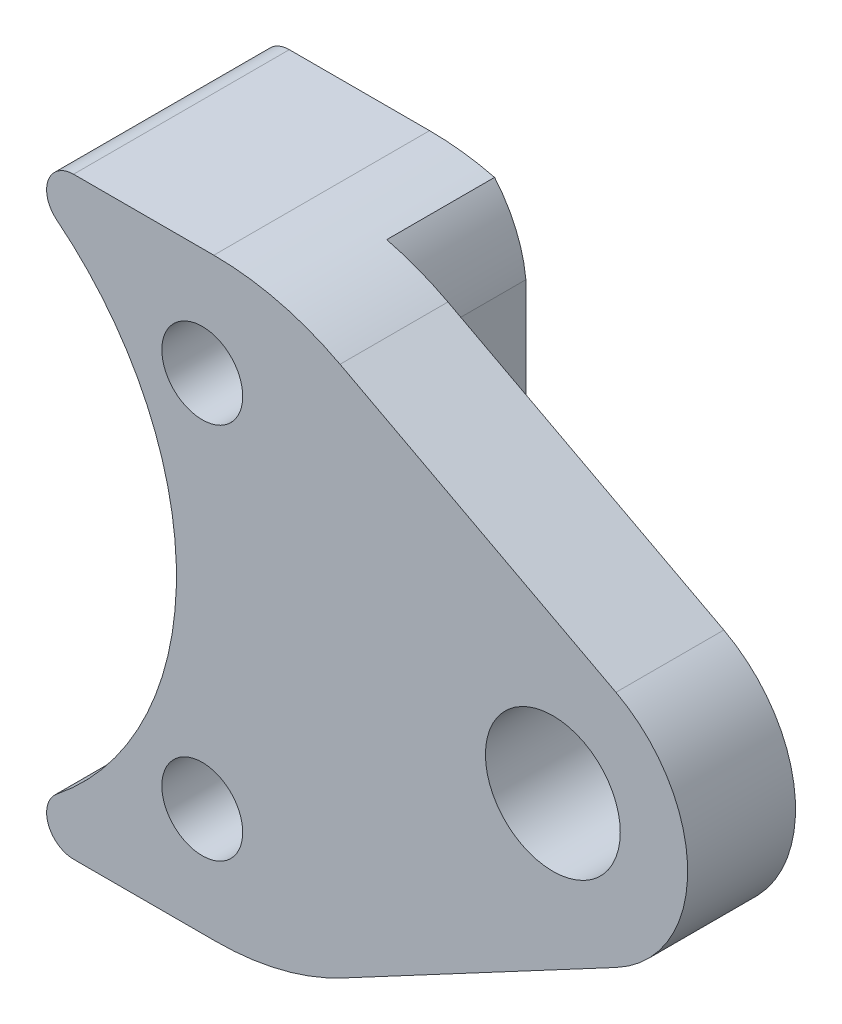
ISO-10303-21;
HEADER;
FILE_DESCRIPTION(('STEP AP214'),'2;1');
FILE_NAME('part.step','',(''),(''),'','','');
FILE_SCHEMA(('AUTOMOTIVE_DESIGN { 1 0 10303 214 1 1 1 1 }'));
ENDSEC;
DATA;
#1=APPLICATION_CONTEXT('core data for automotive mechanical design processes');
#2=APPLICATION_PROTOCOL_DEFINITION('international standard','automotive_design',2000,#1);
#3=PRODUCT_CONTEXT('',#1,'mechanical');
#4=PRODUCT('Part','Part','',(#3));
#5=PRODUCT_RELATED_PRODUCT_CATEGORY('part','',(#4));
#6=PRODUCT_DEFINITION_FORMATION('','',#4);
#7=PRODUCT_DEFINITION_CONTEXT('part definition',#1,'design');
#8=PRODUCT_DEFINITION('design','',#6,#7);
#9=PRODUCT_DEFINITION_SHAPE('','',#8);
#10=(LENGTH_UNIT() NAMED_UNIT(*) SI_UNIT(.MILLI.,.METRE.));
#11=(NAMED_UNIT(*) PLANE_ANGLE_UNIT() SI_UNIT($,.RADIAN.));
#12=(NAMED_UNIT(*) SI_UNIT($,.STERADIAN.) SOLID_ANGLE_UNIT());
#13=UNCERTAINTY_MEASURE_WITH_UNIT(LENGTH_MEASURE(1.E-05),#10,'distance_accuracy_value','');
#14=(GEOMETRIC_REPRESENTATION_CONTEXT(3) GLOBAL_UNCERTAINTY_ASSIGNED_CONTEXT((#13)) GLOBAL_UNIT_ASSIGNED_CONTEXT((#10,
#11,#12)) REPRESENTATION_CONTEXT('',''));
#15=CARTESIAN_POINT('',(0.,0.,0.));
#16=DIRECTION('',(0.,0.,1.));
#17=DIRECTION('',(1.,0.,0.));
#18=AXIS2_PLACEMENT_3D('',#15,#16,#17);
#19=CARTESIAN_POINT('',(20.,-11.,8.));
#20=DIRECTION('',(-0.470588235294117,0.882352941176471,0.));
#21=DIRECTION('',(-0.882352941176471,-0.470588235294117,0.));
#22=AXIS2_PLACEMENT_3D('',#19,#20,#21);
#23=PLANE('',#22);
#24=DIRECTION('',(-0.88235294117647,-0.470588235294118,0.));
#25=VECTOR('',#24,1.);
#26=CARTESIAN_POINT('',(22.2058823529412,-9.82352941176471,4.));
#27=LINE('',#26,#25);
#28=CARTESIAN_POINT('',(32.3529411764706,-4.41176470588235,4.));
#29=VERTEX_POINT('',#28);
#30=CARTESIAN_POINT('',(22.2058823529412,-9.82352941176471,4.));
#31=VERTEX_POINT('',#30);
#32=EDGE_CURVE('E225',#29,#31,#27,.T.);
#33=ORIENTED_EDGE('',*,*,#32,.F.);
#34=DIRECTION('',(0.,0.,-1.));
#35=VECTOR('',#34,1.);
#36=CARTESIAN_POINT('',(32.3529411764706,-4.41176470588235,8.));
#37=LINE('',#36,#35);
#38=CARTESIAN_POINT('',(32.3529411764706,-4.41176470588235,8.));
#39=VERTEX_POINT('',#38);
#40=EDGE_CURVE('E208',#39,#29,#37,.T.);
#41=ORIENTED_EDGE('',*,*,#40,.F.);
#42=DIRECTION('',(0.882352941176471,0.470588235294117,0.));
#43=VECTOR('',#42,1.);
#44=CARTESIAN_POINT('',(20.,-11.,8.));
#45=LINE('',#44,#43);
#46=CARTESIAN_POINT('',(22.2058823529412,-9.82352941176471,8.));
#47=VERTEX_POINT('',#46);
#48=EDGE_CURVE('E196',#47,#39,#45,.T.);
#49=ORIENTED_EDGE('',*,*,#48,.F.);
#50=DIRECTION('',(0.,0.,-1.));
#51=VECTOR('',#50,1.);
#52=CARTESIAN_POINT('',(22.2058823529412,-9.82352941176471,8.));
#53=LINE('',#52,#51);
#54=EDGE_CURVE('E161',#47,#31,#53,.T.);
#55=ORIENTED_EDGE('',*,*,#54,.T.);
#56=EDGE_LOOP('',(#33,#41,#49,#55));
#57=FACE_BOUND('',#56,.T.);
#58=ADVANCED_FACE('F27',(#57),#23,.F.);
#59=CARTESIAN_POINT('',(30.,0.,8.));
#60=DIRECTION('',(0.,0.,-1.));
#61=DIRECTION('',(-1.,0.,0.));
#62=AXIS2_PLACEMENT_3D('',#59,#60,#61);
#63=CYLINDRICAL_SURFACE('',#62,5.);
#64=CARTESIAN_POINT('',(30.,0.,4.));
#65=DIRECTION('',(0.,0.,-1.));
#66=DIRECTION('',(-1.,0.,0.));
#67=AXIS2_PLACEMENT_3D('',#64,#65,#66);
#68=CIRCLE('',#67,5.);
#69=CARTESIAN_POINT('',(32.3401340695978,4.41857132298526,4.));
#70=VERTEX_POINT('',#69);
#71=EDGE_CURVE('E230',#70,#29,#68,.T.);
#72=ORIENTED_EDGE('',*,*,#71,.F.);
#73=DIRECTION('',(0.,0.,-1.));
#74=VECTOR('',#73,1.);
#75=CARTESIAN_POINT('',(32.3401340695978,4.41857132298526,8.));
#76=LINE('',#75,#74);
#77=CARTESIAN_POINT('',(32.3401340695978,4.41857132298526,8.));
#78=VERTEX_POINT('',#77);
#79=EDGE_CURVE('E205',#78,#70,#76,.T.);
#80=ORIENTED_EDGE('',*,*,#79,.F.);
#81=CARTESIAN_POINT('',(30.,0.,8.));
#82=DIRECTION('',(0.,0.,1.));
#83=DIRECTION('',(-1.,0.,0.));
#84=AXIS2_PLACEMENT_3D('',#81,#82,#83);
#85=CIRCLE('',#84,5.);
#86=EDGE_CURVE('E198',#39,#78,#85,.T.);
#87=ORIENTED_EDGE('',*,*,#86,.F.);
#88=ORIENTED_EDGE('',*,*,#40,.T.);
#89=EDGE_LOOP('',(#72,#80,#87,#88));
#90=FACE_BOUND('',#89,.T.);
#91=ADVANCED_FACE('F289',(#90),#63,.T.);
#92=CARTESIAN_POINT('',(19.913276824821,11.,8.));
#93=DIRECTION('',(-0.468026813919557,-0.883714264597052,0.));
#94=DIRECTION('',(0.883714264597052,-0.468026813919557,0.));
#95=AXIS2_PLACEMENT_3D('',#92,#93,#94);
#96=PLANE('',#95);
#97=DIRECTION('',(0.883714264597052,-0.468026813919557,0.));
#98=VECTOR('',#97,1.);
#99=CARTESIAN_POINT('',(32.3401340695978,4.41857132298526,4.));
#100=LINE('',#99,#98);
#101=CARTESIAN_POINT('',(22.1089493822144,9.83714264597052,4.));
#102=VERTEX_POINT('',#101);
#103=EDGE_CURVE('E141',#102,#70,#100,.T.);
#104=ORIENTED_EDGE('',*,*,#103,.F.);
#105=DIRECTION('',(0.,0.,-1.));
#106=VECTOR('',#105,1.);
#107=CARTESIAN_POINT('',(22.1089493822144,9.83714264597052,8.));
#108=LINE('',#107,#106);
#109=CARTESIAN_POINT('',(22.1089493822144,9.83714264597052,8.));
#110=VERTEX_POINT('',#109);
#111=EDGE_CURVE('E11',#102,#110,#108,.F.);
#112=ORIENTED_EDGE('',*,*,#111,.T.);
#113=DIRECTION('',(-0.883714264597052,0.468026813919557,0.));
#114=VECTOR('',#113,1.);
#115=CARTESIAN_POINT('',(19.913276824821,11.,8.));
#116=LINE('',#115,#114);
#117=EDGE_CURVE('E200',#78,#110,#116,.T.);
#118=ORIENTED_EDGE('',*,*,#117,.F.);
#119=ORIENTED_EDGE('',*,*,#79,.T.);
#120=EDGE_LOOP('',(#104,#112,#118,#119));
#121=FACE_BOUND('',#120,.T.);
#122=ADVANCED_FACE('F295',(#121),#96,.F.);
#123=CARTESIAN_POINT('',(30.,0.,8.));
#124=DIRECTION('',(0.,0.,-1.));
#125=DIRECTION('',(-1.,0.,0.));
#126=AXIS2_PLACEMENT_3D('',#123,#124,#125);
#127=CYLINDRICAL_SURFACE('',#126,2.50000000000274);
#128=CARTESIAN_POINT('',(30.,0.,8.));
#129=DIRECTION('',(0.,0.,1.));
#130=DIRECTION('',(1.,0.,0.));
#131=AXIS2_PLACEMENT_3D('',#128,#129,#130);
#132=CIRCLE('',#131,2.50000000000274);
#133=CARTESIAN_POINT('',(32.5000000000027,0.,8.));
#134=VERTEX_POINT('',#133);
#135=EDGE_CURVE('E248',#134,#134,#132,.T.);
#136=ORIENTED_EDGE('',*,*,#135,.T.);
#137=EDGE_LOOP('',(#136));
#138=FACE_BOUND('',#137,.T.);
#139=CARTESIAN_POINT('',(30.,0.,4.));
#140=DIRECTION('',(0.,0.,-1.));
#141=DIRECTION('',(-1.,0.,0.));
#142=AXIS2_PLACEMENT_3D('',#139,#140,#141);
#143=CIRCLE('',#142,2.50000000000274);
#144=CARTESIAN_POINT('',(27.4999999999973,0.,4.));
#145=VERTEX_POINT('',#144);
#146=EDGE_CURVE('E242',#145,#145,#143,.T.);
#147=ORIENTED_EDGE('',*,*,#146,.T.);
#148=EDGE_LOOP('',(#147));
#149=FACE_BOUND('',#148,.T.);
#150=ADVANCED_FACE('F331',(#138,#149),#127,.F.);
#151=CARTESIAN_POINT('',(12.227935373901,10.,8.));
#152=DIRECTION('',(0.,0.,1.));
#153=DIRECTION('',(1.,0.,0.));
#154=AXIS2_PLACEMENT_3D('',#151,#152,#153);
#155=PLANE('',#154);
#156=CARTESIAN_POINT('',(17.,-7.,8.));
#157=DIRECTION('',(0.,0.,1.));
#158=DIRECTION('',(-1.,0.,0.));
#159=AXIS2_PLACEMENT_3D('',#156,#157,#158);
#160=CIRCLE('',#159,1.5);
#161=CARTESIAN_POINT('',(15.5,-7.,8.));
#162=VERTEX_POINT('',#161);
#163=EDGE_CURVE('E254',#162,#162,#160,.T.);
#164=ORIENTED_EDGE('',*,*,#163,.F.);
#165=EDGE_LOOP('',(#164));
#166=FACE_BOUND('',#165,.T.);
#167=DIRECTION('',(1.,0.,0.));
#168=VECTOR('',#167,1.);
#169=CARTESIAN_POINT('',(20.,-11.,8.));
#170=LINE('',#169,#168);
#171=CARTESIAN_POINT('',(12.227935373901,-11.,8.));
#172=VERTEX_POINT('',#171);
#173=CARTESIAN_POINT('',(17.5,-11.,8.));
#174=VERTEX_POINT('',#173);
#175=EDGE_CURVE('E193',#172,#174,#170,.T.);
#176=ORIENTED_EDGE('',*,*,#175,.T.);
#177=CARTESIAN_POINT('',(17.5,-0.999999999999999,8.));
#178=DIRECTION('',(0.,0.,1.));
#179=DIRECTION('',(1.,0.,0.));
#180=AXIS2_PLACEMENT_3D('',#177,#178,#179);
#181=CIRCLE('',#180,10.);
#182=EDGE_CURVE('E166',#174,#47,#181,.T.);
#183=ORIENTED_EDGE('',*,*,#182,.T.);
#184=ORIENTED_EDGE('',*,*,#48,.T.);
#185=ORIENTED_EDGE('',*,*,#86,.T.);
#186=ORIENTED_EDGE('',*,*,#117,.T.);
#187=CARTESIAN_POINT('',(17.4286812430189,0.999999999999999,8.));
#188=DIRECTION('',(0.,0.,1.));
#189=DIRECTION('',(1.,0.,0.));
#190=AXIS2_PLACEMENT_3D('',#187,#188,#189);
#191=CIRCLE('',#190,10.);
#192=CARTESIAN_POINT('',(17.4286812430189,11.,8.));
#193=VERTEX_POINT('',#192);
#194=EDGE_CURVE('E50',#110,#193,#191,.T.);
#195=ORIENTED_EDGE('',*,*,#194,.T.);
#196=DIRECTION('',(-1.,0.,0.));
#197=VECTOR('',#196,1.);
#198=CARTESIAN_POINT('',(19.913276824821,11.,8.));
#199=LINE('',#198,#197);
#200=CARTESIAN_POINT('',(12.227935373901,11.,8.));
#201=VERTEX_POINT('',#200);
#202=EDGE_CURVE('E175',#193,#201,#199,.T.);
#203=ORIENTED_EDGE('',*,*,#202,.T.);
#204=CARTESIAN_POINT('',(12.227935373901,10.,8.));
#205=DIRECTION('',(0.,0.,1.));
#206=DIRECTION('',(1.,0.,0.));
#207=AXIS2_PLACEMENT_3D('',#204,#205,#206);
#208=CIRCLE('',#207,1.);
#209=CARTESIAN_POINT('',(11.6042926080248,9.21829052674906,8.));
#210=VERTEX_POINT('',#209);
#211=EDGE_CURVE('E180',#201,#210,#208,.T.);
#212=ORIENTED_EDGE('',*,*,#211,.T.);
#213=CARTESIAN_POINT('',(4.24999999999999,0.,8.));
#214=DIRECTION('',(0.,0.,-1.));
#215=DIRECTION('',(-1.,0.,0.));
#216=AXIS2_PLACEMENT_3D('',#213,#214,#215);
#217=CIRCLE('',#216,11.7924764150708);
#218=CARTESIAN_POINT('',(11.6042926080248,-9.21829052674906,8.));
#219=VERTEX_POINT('',#218);
#220=EDGE_CURVE('E184',#210,#219,#217,.T.);
#221=ORIENTED_EDGE('',*,*,#220,.T.);
#222=CARTESIAN_POINT('',(12.227935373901,-10.,8.));
#223=DIRECTION('',(0.,0.,1.));
#224=DIRECTION('',(-1.,0.,0.));
#225=AXIS2_PLACEMENT_3D('',#222,#223,#224);
#226=CIRCLE('',#225,1.);
#227=EDGE_CURVE('E191',#219,#172,#226,.T.);
#228=ORIENTED_EDGE('',*,*,#227,.T.);
#229=EDGE_LOOP('',(#176,#183,#184,#185,#186,#195,#203,#212,#221,#228));
#230=FACE_BOUND('',#229,.T.);
#231=CARTESIAN_POINT('',(17.,7.,8.));
#232=DIRECTION('',(0.,0.,1.));
#233=DIRECTION('',(1.,0.,0.));
#234=AXIS2_PLACEMENT_3D('',#231,#232,#233);
#235=CIRCLE('',#234,1.5);
#236=CARTESIAN_POINT('',(18.5,7.,8.));
#237=VERTEX_POINT('',#236);
#238=EDGE_CURVE('E260',#237,#237,#235,.T.);
#239=ORIENTED_EDGE('',*,*,#238,.F.);
#240=EDGE_LOOP('',(#239));
#241=FACE_BOUND('',#240,.T.);
#242=ORIENTED_EDGE('',*,*,#135,.F.);
#243=EDGE_LOOP('',(#242));
#244=FACE_BOUND('',#243,.T.);
#245=ADVANCED_FACE('F274',(#166,#230,#241,#244),#155,.T.);
#246=CARTESIAN_POINT('',(12.227935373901,10.,0.));
#247=DIRECTION('',(0.,0.,1.));
#248=DIRECTION('',(1.,0.,0.));
#249=AXIS2_PLACEMENT_3D('',#246,#247,#248);
#250=PLANE('',#249);
#251=CARTESIAN_POINT('',(17.,-7.,0.));
#252=DIRECTION('',(0.,0.,1.));
#253=DIRECTION('',(-1.,0.,0.));
#254=AXIS2_PLACEMENT_3D('',#251,#252,#253);
#255=CIRCLE('',#254,1.5);
#256=CARTESIAN_POINT('',(15.5,-7.,0.));
#257=VERTEX_POINT('',#256);
#258=EDGE_CURVE('E251',#257,#257,#255,.T.);
#259=ORIENTED_EDGE('',*,*,#258,.T.);
#260=EDGE_LOOP('',(#259));
#261=FACE_BOUND('',#260,.T.);
#262=CARTESIAN_POINT('',(17.4286812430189,0.999999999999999,0.));
#263=DIRECTION('',(0.,0.,1.));
#264=DIRECTION('',(1.,0.,0.));
#265=AXIS2_PLACEMENT_3D('',#262,#263,#264);
#266=CIRCLE('',#265,10.);
#267=CARTESIAN_POINT('',(17.4286812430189,11.,0.));
#268=VERTEX_POINT('',#267);
#269=CARTESIAN_POINT('',(19.8399644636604,10.704932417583,0.));
#270=VERTEX_POINT('',#269);
#271=EDGE_CURVE('E158',#268,#270,#266,.F.);
#272=ORIENTED_EDGE('',*,*,#271,.T.);
#273=CARTESIAN_POINT('',(16.0979549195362,7.49892442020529,0.));
#274=DIRECTION('',(0.,0.,1.));
#275=DIRECTION('',(-1.,0.,0.));
#276=AXIS2_PLACEMENT_3D('',#273,#274,#275);
#277=CIRCLE('',#276,4.927587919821);
#278=CARTESIAN_POINT('',(21.,7.99999999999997,0.));
#279=VERTEX_POINT('',#278);
#280=EDGE_CURVE('E420',#279,#270,#277,.T.);
#281=ORIENTED_EDGE('',*,*,#280,.F.);
#282=DIRECTION('',(0.,1.,0.));
#283=VECTOR('',#282,1.);
#284=CARTESIAN_POINT('',(21.,-7.99999999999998,0.));
#285=LINE('',#284,#283);
#286=CARTESIAN_POINT('',(21.,-7.99999999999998,0.));
#287=VERTEX_POINT('',#286);
#288=EDGE_CURVE('E152',#287,#279,#285,.T.);
#289=ORIENTED_EDGE('',*,*,#288,.F.);
#290=CARTESIAN_POINT('',(17.5241270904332,-7.84098135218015,0.));
#291=DIRECTION('',(0.,0.,1.));
#292=DIRECTION('',(-1.,0.,0.));
#293=AXIS2_PLACEMENT_3D('',#290,#291,#292);
#294=CIRCLE('',#293,3.47950850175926);
#295=CARTESIAN_POINT('',(19.2914781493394,-10.8382216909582,0.));
#296=VERTEX_POINT('',#295);
#297=EDGE_CURVE('E132',#296,#287,#294,.T.);
#298=ORIENTED_EDGE('',*,*,#297,.F.);
#299=CARTESIAN_POINT('',(17.5,-0.999999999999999,0.));
#300=DIRECTION('',(0.,0.,1.));
#301=DIRECTION('',(1.,0.,0.));
#302=AXIS2_PLACEMENT_3D('',#299,#300,#301);
#303=CIRCLE('',#302,10.);
#304=CARTESIAN_POINT('',(17.5,-11.,0.));
#305=VERTEX_POINT('',#304);
#306=EDGE_CURVE('E148',#296,#305,#303,.F.);
#307=ORIENTED_EDGE('',*,*,#306,.T.);
#308=DIRECTION('',(1.,0.,0.));
#309=VECTOR('',#308,1.);
#310=CARTESIAN_POINT('',(20.,-11.,0.));
#311=LINE('',#310,#309);
#312=CARTESIAN_POINT('',(12.227935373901,-11.,0.));
#313=VERTEX_POINT('',#312);
#314=EDGE_CURVE('E181',#313,#305,#311,.T.);
#315=ORIENTED_EDGE('',*,*,#314,.F.);
#316=CARTESIAN_POINT('',(12.227935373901,-10.,0.));
#317=DIRECTION('',(0.,0.,1.));
#318=DIRECTION('',(-1.,0.,0.));
#319=AXIS2_PLACEMENT_3D('',#316,#317,#318);
#320=CIRCLE('',#319,1.);
#321=CARTESIAN_POINT('',(11.6042926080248,-9.21829052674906,0.));
#322=VERTEX_POINT('',#321);
#323=EDGE_CURVE('E186',#322,#313,#320,.T.);
#324=ORIENTED_EDGE('',*,*,#323,.F.);
#325=CARTESIAN_POINT('',(4.24999999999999,0.,0.));
#326=DIRECTION('',(0.,0.,-1.));
#327=DIRECTION('',(-1.,0.,0.));
#328=AXIS2_PLACEMENT_3D('',#325,#326,#327);
#329=CIRCLE('',#328,11.7924764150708);
#330=CARTESIAN_POINT('',(11.6042926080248,9.21829052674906,0.));
#331=VERTEX_POINT('',#330);
#332=EDGE_CURVE('E264',#331,#322,#329,.T.);
#333=ORIENTED_EDGE('',*,*,#332,.F.);
#334=CARTESIAN_POINT('',(12.227935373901,10.,0.));
#335=DIRECTION('',(0.,0.,1.));
#336=DIRECTION('',(1.,0.,0.));
#337=AXIS2_PLACEMENT_3D('',#334,#335,#336);
#338=CIRCLE('',#337,1.);
#339=CARTESIAN_POINT('',(12.227935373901,11.,0.));
#340=VERTEX_POINT('',#339);
#341=EDGE_CURVE('E179',#340,#331,#338,.T.);
#342=ORIENTED_EDGE('',*,*,#341,.F.);
#343=DIRECTION('',(-1.,0.,0.));
#344=VECTOR('',#343,1.);
#345=CARTESIAN_POINT('',(19.913276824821,11.,0.));
#346=LINE('',#345,#344);
#347=EDGE_CURVE('E173',#268,#340,#346,.T.);
#348=ORIENTED_EDGE('',*,*,#347,.F.);
#349=EDGE_LOOP('',(#272,#281,#289,#298,#307,#315,#324,#333,#342,#348));
#350=FACE_BOUND('',#349,.T.);
#351=CARTESIAN_POINT('',(17.,7.,0.));
#352=DIRECTION('',(0.,0.,1.));
#353=DIRECTION('',(1.,0.,0.));
#354=AXIS2_PLACEMENT_3D('',#351,#352,#353);
#355=CIRCLE('',#354,1.5);
#356=CARTESIAN_POINT('',(18.5,7.,0.));
#357=VERTEX_POINT('',#356);
#358=EDGE_CURVE('E257',#357,#357,#355,.T.);
#359=ORIENTED_EDGE('',*,*,#358,.T.);
#360=EDGE_LOOP('',(#359));
#361=FACE_BOUND('',#360,.T.);
#362=ADVANCED_FACE('F145',(#261,#350,#361),#250,.F.);
#363=CARTESIAN_POINT('',(12.227935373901,10.,8.));
#364=DIRECTION('',(0.,0.,-1.));
#365=DIRECTION('',(-1.,0.,0.));
#366=AXIS2_PLACEMENT_3D('',#363,#364,#365);
#367=CYLINDRICAL_SURFACE('',#366,1.);
#368=ORIENTED_EDGE('',*,*,#341,.T.);
#369=DIRECTION('',(0.,0.,-1.));
#370=VECTOR('',#369,1.);
#371=CARTESIAN_POINT('',(11.6042926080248,9.21829052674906,8.));
#372=LINE('',#371,#370);
#373=EDGE_CURVE('E217',#210,#331,#372,.T.);
#374=ORIENTED_EDGE('',*,*,#373,.F.);
#375=ORIENTED_EDGE('',*,*,#211,.F.);
#376=DIRECTION('',(0.,0.,-1.));
#377=VECTOR('',#376,1.);
#378=CARTESIAN_POINT('',(12.227935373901,11.,8.));
#379=LINE('',#378,#377);
#380=EDGE_CURVE('E203',#201,#340,#379,.T.);
#381=ORIENTED_EDGE('',*,*,#380,.T.);
#382=EDGE_LOOP('',(#368,#374,#375,#381));
#383=FACE_BOUND('',#382,.T.);
#384=ADVANCED_FACE('F29',(#383),#367,.T.);
#385=CARTESIAN_POINT('',(4.24999999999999,0.,8.));
#386=DIRECTION('',(0.,0.,-1.));
#387=DIRECTION('',(-1.,0.,0.));
#388=AXIS2_PLACEMENT_3D('',#385,#386,#387);
#389=CYLINDRICAL_SURFACE('',#388,11.7924764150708);
#390=ORIENTED_EDGE('',*,*,#332,.T.);
#391=DIRECTION('',(0.,0.,-1.));
#392=VECTOR('',#391,1.);
#393=CARTESIAN_POINT('',(11.6042926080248,-9.21829052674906,8.));
#394=LINE('',#393,#392);
#395=EDGE_CURVE('E214',#219,#322,#394,.T.);
#396=ORIENTED_EDGE('',*,*,#395,.F.);
#397=ORIENTED_EDGE('',*,*,#220,.F.);
#398=ORIENTED_EDGE('',*,*,#373,.T.);
#399=EDGE_LOOP('',(#390,#396,#397,#398));
#400=FACE_BOUND('',#399,.T.);
#401=ADVANCED_FACE('F279',(#400),#389,.F.);
#402=CARTESIAN_POINT('',(12.227935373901,-10.,8.));
#403=DIRECTION('',(0.,0.,-1.));
#404=DIRECTION('',(-1.,0.,0.));
#405=AXIS2_PLACEMENT_3D('',#402,#403,#404);
#406=CYLINDRICAL_SURFACE('',#405,1.);
#407=ORIENTED_EDGE('',*,*,#323,.T.);
#408=DIRECTION('',(0.,0.,-1.));
#409=VECTOR('',#408,1.);
#410=CARTESIAN_POINT('',(12.227935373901,-11.,8.));
#411=LINE('',#410,#409);
#412=EDGE_CURVE('E211',#172,#313,#411,.T.);
#413=ORIENTED_EDGE('',*,*,#412,.F.);
#414=ORIENTED_EDGE('',*,*,#227,.F.);
#415=ORIENTED_EDGE('',*,*,#395,.T.);
#416=EDGE_LOOP('',(#407,#413,#414,#415));
#417=FACE_BOUND('',#416,.T.);
#418=ADVANCED_FACE('F268',(#417),#406,.T.);
#419=CARTESIAN_POINT('',(20.,-11.,8.));
#420=DIRECTION('',(0.,1.,0.));
#421=DIRECTION('',(0.,0.,1.));
#422=AXIS2_PLACEMENT_3D('',#419,#420,#421);
#423=PLANE('',#422);
#424=ORIENTED_EDGE('',*,*,#314,.T.);
#425=DIRECTION('',(0.,0.,-1.));
#426=VECTOR('',#425,1.);
#427=CARTESIAN_POINT('',(17.5,-11.,8.));
#428=LINE('',#427,#426);
#429=EDGE_CURVE('E157',#305,#174,#428,.F.);
#430=ORIENTED_EDGE('',*,*,#429,.T.);
#431=ORIENTED_EDGE('',*,*,#175,.F.);
#432=ORIENTED_EDGE('',*,*,#412,.T.);
#433=EDGE_LOOP('',(#424,#430,#431,#432));
#434=FACE_BOUND('',#433,.T.);
#435=ADVANCED_FACE('F273',(#434),#423,.F.);
#436=CARTESIAN_POINT('',(19.913276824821,11.,8.));
#437=DIRECTION('',(0.,-1.,0.));
#438=DIRECTION('',(0.,0.,-1.));
#439=AXIS2_PLACEMENT_3D('',#436,#437,#438);
#440=PLANE('',#439);
#441=ORIENTED_EDGE('',*,*,#202,.F.);
#442=DIRECTION('',(0.,0.,-1.));
#443=VECTOR('',#442,1.);
#444=CARTESIAN_POINT('',(17.4286812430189,11.,8.));
#445=LINE('',#444,#443);
#446=EDGE_CURVE('E35',#193,#268,#445,.T.);
#447=ORIENTED_EDGE('',*,*,#446,.T.);
#448=ORIENTED_EDGE('',*,*,#347,.T.);
#449=ORIENTED_EDGE('',*,*,#380,.F.);
#450=EDGE_LOOP('',(#441,#447,#448,#449));
#451=FACE_BOUND('',#450,.T.);
#452=ADVANCED_FACE('F171',(#451),#440,.F.);
#453=CARTESIAN_POINT('',(17.,7.,8.));
#454=DIRECTION('',(0.,0.,-1.));
#455=DIRECTION('',(-1.,0.,0.));
#456=AXIS2_PLACEMENT_3D('',#453,#454,#455);
#457=CYLINDRICAL_SURFACE('',#456,1.5);
#458=ORIENTED_EDGE('',*,*,#238,.T.);
#459=EDGE_LOOP('',(#458));
#460=FACE_BOUND('',#459,.T.);
#461=ORIENTED_EDGE('',*,*,#358,.F.);
#462=EDGE_LOOP('',(#461));
#463=FACE_BOUND('',#462,.T.);
#464=ADVANCED_FACE('F311',(#460,#463),#457,.F.);
#465=CARTESIAN_POINT('',(17.,-7.,8.));
#466=DIRECTION('',(0.,0.,-1.));
#467=DIRECTION('',(-1.,0.,0.));
#468=AXIS2_PLACEMENT_3D('',#465,#466,#467);
#469=CYLINDRICAL_SURFACE('',#468,1.5);
#470=ORIENTED_EDGE('',*,*,#163,.T.);
#471=EDGE_LOOP('',(#470));
#472=FACE_BOUND('',#471,.T.);
#473=ORIENTED_EDGE('',*,*,#258,.F.);
#474=EDGE_LOOP('',(#473));
#475=FACE_BOUND('',#474,.T.);
#476=ADVANCED_FACE('F315',(#472,#475),#469,.F.);
#477=CARTESIAN_POINT('',(17.5,-0.999999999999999,8.));
#478=DIRECTION('',(0.,0.,-1.));
#479=DIRECTION('',(-1.,0.,0.));
#480=AXIS2_PLACEMENT_3D('',#477,#478,#479);
#481=CYLINDRICAL_SURFACE('',#480,10.);
#482=DIRECTION('',(0.,0.,-1.));
#483=VECTOR('',#482,1.);
#484=CARTESIAN_POINT('',(19.2914781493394,-10.8382216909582,4.));
#485=LINE('',#484,#483);
#486=CARTESIAN_POINT('',(19.2914781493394,-10.8382216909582,4.));
#487=VERTEX_POINT('',#486);
#488=EDGE_CURVE('E129',#487,#296,#485,.T.);
#489=ORIENTED_EDGE('',*,*,#488,.F.);
#490=CARTESIAN_POINT('',(17.5,-1.00000000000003,4.));
#491=DIRECTION('',(0.,0.,-1.));
#492=DIRECTION('',(-1.,0.,0.));
#493=AXIS2_PLACEMENT_3D('',#490,#491,#492);
#494=CIRCLE('',#493,9.99999999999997);
#495=EDGE_CURVE('E226',#31,#487,#494,.T.);
#496=ORIENTED_EDGE('',*,*,#495,.F.);
#497=ORIENTED_EDGE('',*,*,#54,.F.);
#498=ORIENTED_EDGE('',*,*,#182,.F.);
#499=ORIENTED_EDGE('',*,*,#429,.F.);
#500=ORIENTED_EDGE('',*,*,#306,.F.);
#501=EDGE_LOOP('',(#489,#496,#497,#498,#499,#500));
#502=FACE_BOUND('',#501,.T.);
#503=ADVANCED_FACE('F155',(#502),#481,.T.);
#504=CARTESIAN_POINT('',(17.4286812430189,0.999999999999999,8.));
#505=DIRECTION('',(0.,0.,-1.));
#506=DIRECTION('',(-1.,0.,0.));
#507=AXIS2_PLACEMENT_3D('',#504,#505,#506);
#508=CYLINDRICAL_SURFACE('',#507,10.);
#509=DIRECTION('',(0.,0.,-1.));
#510=VECTOR('',#509,1.);
#511=CARTESIAN_POINT('',(19.8399644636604,10.704932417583,4.));
#512=LINE('',#511,#510);
#513=CARTESIAN_POINT('',(19.8399644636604,10.704932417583,4.));
#514=VERTEX_POINT('',#513);
#515=EDGE_CURVE('E239',#514,#270,#512,.T.);
#516=ORIENTED_EDGE('',*,*,#515,.T.);
#517=ORIENTED_EDGE('',*,*,#271,.F.);
#518=ORIENTED_EDGE('',*,*,#446,.F.);
#519=ORIENTED_EDGE('',*,*,#194,.F.);
#520=ORIENTED_EDGE('',*,*,#111,.F.);
#521=CARTESIAN_POINT('',(17.4286812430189,1.00000000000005,4.));
#522=DIRECTION('',(0.,0.,-1.));
#523=DIRECTION('',(1.,0.,0.));
#524=AXIS2_PLACEMENT_3D('',#521,#522,#523);
#525=CIRCLE('',#524,9.99999999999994);
#526=EDGE_CURVE('E236',#514,#102,#525,.T.);
#527=ORIENTED_EDGE('',*,*,#526,.F.);
#528=EDGE_LOOP('',(#516,#517,#518,#519,#520,#527));
#529=FACE_BOUND('',#528,.T.);
#530=ADVANCED_FACE('F357',(#529),#508,.T.);
#531=CARTESIAN_POINT('',(16.0979549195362,7.49892442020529,4.));
#532=DIRECTION('',(0.,0.,-1.));
#533=DIRECTION('',(-1.,0.,0.));
#534=AXIS2_PLACEMENT_3D('',#531,#532,#533);
#535=CYLINDRICAL_SURFACE('',#534,4.927587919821);
#536=ORIENTED_EDGE('',*,*,#280,.T.);
#537=ORIENTED_EDGE('',*,*,#515,.F.);
#538=CARTESIAN_POINT('',(16.0979549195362,7.49892442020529,4.));
#539=DIRECTION('',(0.,0.,1.));
#540=DIRECTION('',(-1.,0.,0.));
#541=AXIS2_PLACEMENT_3D('',#538,#539,#540);
#542=CIRCLE('',#541,4.927587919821);
#543=CARTESIAN_POINT('',(21.,7.99999999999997,4.));
#544=VERTEX_POINT('',#543);
#545=EDGE_CURVE('E42',#544,#514,#542,.T.);
#546=ORIENTED_EDGE('',*,*,#545,.F.);
#547=DIRECTION('',(0.,0.,-1.));
#548=VECTOR('',#547,1.);
#549=CARTESIAN_POINT('',(21.,7.99999999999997,4.));
#550=LINE('',#549,#548);
#551=EDGE_CURVE('E243',#544,#279,#550,.T.);
#552=ORIENTED_EDGE('',*,*,#551,.T.);
#553=EDGE_LOOP('',(#536,#537,#546,#552));
#554=FACE_BOUND('',#553,.T.);
#555=ADVANCED_FACE('F369',(#554),#535,.T.);
#556=CARTESIAN_POINT('',(21.,-7.99999999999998,4.));
#557=DIRECTION('',(-1.,0.,0.));
#558=DIRECTION('',(0.,0.,1.));
#559=AXIS2_PLACEMENT_3D('',#556,#557,#558);
#560=PLANE('',#559);
#561=ORIENTED_EDGE('',*,*,#288,.T.);
#562=ORIENTED_EDGE('',*,*,#551,.F.);
#563=DIRECTION('',(0.,1.,0.));
#564=VECTOR('',#563,1.);
#565=CARTESIAN_POINT('',(21.,-7.99999999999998,4.));
#566=LINE('',#565,#564);
#567=CARTESIAN_POINT('',(21.,-7.99999999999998,4.));
#568=VERTEX_POINT('',#567);
#569=EDGE_CURVE('E228',#568,#544,#566,.T.);
#570=ORIENTED_EDGE('',*,*,#569,.F.);
#571=DIRECTION('',(0.,0.,-1.));
#572=VECTOR('',#571,1.);
#573=CARTESIAN_POINT('',(21.,-7.99999999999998,4.));
#574=LINE('',#573,#572);
#575=EDGE_CURVE('E140',#568,#287,#574,.T.);
#576=ORIENTED_EDGE('',*,*,#575,.T.);
#577=EDGE_LOOP('',(#561,#562,#570,#576));
#578=FACE_BOUND('',#577,.T.);
#579=ADVANCED_FACE('F365',(#578),#560,.F.);
#580=CARTESIAN_POINT('',(17.5241270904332,-7.84098135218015,4.));
#581=DIRECTION('',(0.,0.,-1.));
#582=DIRECTION('',(-1.,0.,0.));
#583=AXIS2_PLACEMENT_3D('',#580,#581,#582);
#584=CYLINDRICAL_SURFACE('',#583,3.47950850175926);
#585=ORIENTED_EDGE('',*,*,#297,.T.);
#586=ORIENTED_EDGE('',*,*,#575,.F.);
#587=CARTESIAN_POINT('',(17.5241270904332,-7.84098135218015,4.));
#588=DIRECTION('',(0.,0.,1.));
#589=DIRECTION('',(-1.,0.,0.));
#590=AXIS2_PLACEMENT_3D('',#587,#588,#589);
#591=CIRCLE('',#590,3.47950850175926);
#592=EDGE_CURVE('E135',#487,#568,#591,.T.);
#593=ORIENTED_EDGE('',*,*,#592,.F.);
#594=ORIENTED_EDGE('',*,*,#488,.T.);
#595=EDGE_LOOP('',(#585,#586,#593,#594));
#596=FACE_BOUND('',#595,.T.);
#597=ADVANCED_FACE('F131',(#596),#584,.T.);
#598=CARTESIAN_POINT('',(30.,0.,4.));
#599=DIRECTION('',(0.,0.,-1.));
#600=DIRECTION('',(-1.,0.,0.));
#601=AXIS2_PLACEMENT_3D('',#598,#599,#600);
#602=PLANE('',#601);
#603=ORIENTED_EDGE('',*,*,#146,.F.);
#604=EDGE_LOOP('',(#603));
#605=FACE_BOUND('',#604,.T.);
#606=ORIENTED_EDGE('',*,*,#71,.T.);
#607=ORIENTED_EDGE('',*,*,#32,.T.);
#608=ORIENTED_EDGE('',*,*,#495,.T.);
#609=ORIENTED_EDGE('',*,*,#592,.T.);
#610=ORIENTED_EDGE('',*,*,#569,.T.);
#611=ORIENTED_EDGE('',*,*,#545,.T.);
#612=ORIENTED_EDGE('',*,*,#526,.T.);
#613=ORIENTED_EDGE('',*,*,#103,.T.);
#614=EDGE_LOOP('',(#606,#607,#608,#609,#610,#611,#612,#613));
#615=FACE_BOUND('',#614,.T.);
#616=ADVANCED_FACE('F358',(#605,#615),#602,.T.);
#617=CLOSED_SHELL('',(#58,#91,#122,#150,#245,#362,#384,#401,#418,#435,#452,#464,#476,#503,#530,
#555,#579,#597,#616));
#618=MANIFOLD_SOLID_BREP('B2',#617);
#619=ADVANCED_BREP_SHAPE_REPRESENTATION('',(#18,#618),#14);
#620=SHAPE_DEFINITION_REPRESENTATION(#9,#619);
ENDSEC;
END-ISO-10303-21;
